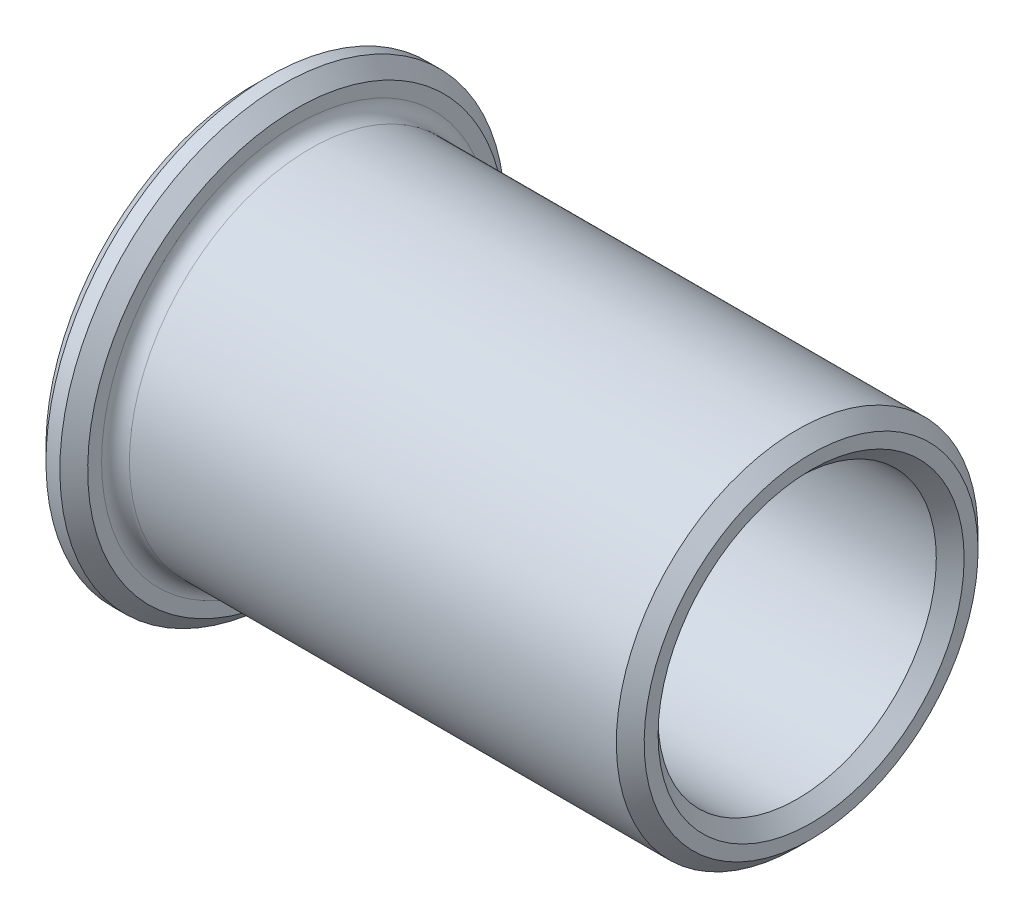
ISO-10303-21;
HEADER;
FILE_DESCRIPTION(('STEP AP214'),'2;1');
FILE_NAME('part.step','',(''),(''),'','','');
FILE_SCHEMA(('AUTOMOTIVE_DESIGN { 1 0 10303 214 1 1 1 1 }'));
ENDSEC;
DATA;
#1=APPLICATION_CONTEXT('core data for automotive mechanical design processes');
#2=APPLICATION_PROTOCOL_DEFINITION('international standard','automotive_design',2000,#1);
#3=PRODUCT_CONTEXT('',#1,'mechanical');
#4=PRODUCT('Part','Part','',(#3));
#5=PRODUCT_RELATED_PRODUCT_CATEGORY('part','',(#4));
#6=PRODUCT_DEFINITION_FORMATION('','',#4);
#7=PRODUCT_DEFINITION_CONTEXT('part definition',#1,'design');
#8=PRODUCT_DEFINITION('design','',#6,#7);
#9=PRODUCT_DEFINITION_SHAPE('','',#8);
#10=(LENGTH_UNIT() NAMED_UNIT(*) SI_UNIT(.MILLI.,.METRE.));
#11=(NAMED_UNIT(*) PLANE_ANGLE_UNIT() SI_UNIT($,.RADIAN.));
#12=(NAMED_UNIT(*) SI_UNIT($,.STERADIAN.) SOLID_ANGLE_UNIT());
#13=UNCERTAINTY_MEASURE_WITH_UNIT(LENGTH_MEASURE(1.E-05),#10,'distance_accuracy_value','');
#14=(GEOMETRIC_REPRESENTATION_CONTEXT(3) GLOBAL_UNCERTAINTY_ASSIGNED_CONTEXT((#13)) GLOBAL_UNIT_ASSIGNED_CONTEXT((#10,
#11,#12)) REPRESENTATION_CONTEXT('',''));
#15=CARTESIAN_POINT('',(0.,0.,0.));
#16=DIRECTION('',(0.,0.,1.));
#17=DIRECTION('',(1.,0.,0.));
#18=AXIS2_PLACEMENT_3D('',#15,#16,#17);
#19=CARTESIAN_POINT('',(-1.5,-6.5,0.));
#20=DIRECTION('',(-1.,0.,0.));
#21=DIRECTION('',(0.,-1.,0.));
#22=AXIS2_PLACEMENT_3D('',#19,#20,#21);
#23=PLANE('',#22);
#24=CARTESIAN_POINT('',(-1.5,0.,0.));
#25=DIRECTION('',(1.,0.,0.));
#26=DIRECTION('',(0.,-1.,0.));
#27=AXIS2_PLACEMENT_3D('',#24,#25,#26);
#28=CIRCLE('',#27,5.50000000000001);
#29=CARTESIAN_POINT('',(-1.5,-5.50000000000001,0.));
#30=VERTEX_POINT('',#29);
#31=EDGE_CURVE('E8',#30,#30,#28,.T.);
#32=ORIENTED_EDGE('',*,*,#31,.T.);
#33=EDGE_LOOP('',(#32));
#34=FACE_BOUND('',#33,.T.);
#35=CARTESIAN_POINT('',(-1.5,0.,0.));
#36=DIRECTION('',(1.,0.,0.));
#37=DIRECTION('',(0.,-1.,0.));
#38=AXIS2_PLACEMENT_3D('',#35,#36,#37);
#39=CIRCLE('',#38,7.5);
#40=CARTESIAN_POINT('',(-1.5,-7.5,0.));
#41=VERTEX_POINT('',#40);
#42=EDGE_CURVE('E56',#41,#41,#39,.T.);
#43=ORIENTED_EDGE('',*,*,#42,.F.);
#44=EDGE_LOOP('',(#43));
#45=FACE_BOUND('',#44,.T.);
#46=ADVANCED_FACE('F13',(#34,#45),#23,.T.);
#47=CARTESIAN_POINT('',(18.5,-5.75,0.));
#48=DIRECTION('',(1.,0.,0.));
#49=DIRECTION('',(0.,1.,0.));
#50=AXIS2_PLACEMENT_3D('',#47,#48,#49);
#51=PLANE('',#50);
#52=CARTESIAN_POINT('',(18.5,0.,0.));
#53=DIRECTION('',(1.,0.,0.));
#54=DIRECTION('',(0.,-1.,0.));
#55=AXIS2_PLACEMENT_3D('',#52,#53,#54);
#56=CIRCLE('',#55,5.5);
#57=CARTESIAN_POINT('',(18.5,-5.5,0.));
#58=VERTEX_POINT('',#57);
#59=EDGE_CURVE('E41',#58,#58,#56,.T.);
#60=ORIENTED_EDGE('',*,*,#59,.F.);
#61=EDGE_LOOP('',(#60));
#62=FACE_BOUND('',#61,.T.);
#63=CARTESIAN_POINT('',(18.5,0.,0.));
#64=DIRECTION('',(1.,0.,0.));
#65=DIRECTION('',(0.,-1.,0.));
#66=AXIS2_PLACEMENT_3D('',#63,#64,#65);
#67=CIRCLE('',#66,6.);
#68=CARTESIAN_POINT('',(18.5,-6.,0.));
#69=VERTEX_POINT('',#68);
#70=EDGE_CURVE('E22',#69,#69,#67,.T.);
#71=ORIENTED_EDGE('',*,*,#70,.T.);
#72=EDGE_LOOP('',(#71));
#73=FACE_BOUND('',#72,.T.);
#74=ADVANCED_FACE('F102',(#62,#73),#51,.T.);
#75=CARTESIAN_POINT('',(0.,-7.25,0.));
#76=DIRECTION('',(1.,0.,0.));
#77=DIRECTION('',(0.,1.,0.));
#78=AXIS2_PLACEMENT_3D('',#75,#76,#77);
#79=PLANE('',#78);
#80=CARTESIAN_POINT('',(0.,0.,0.));
#81=DIRECTION('',(1.,0.,0.));
#82=DIRECTION('',(0.,-1.,0.));
#83=AXIS2_PLACEMENT_3D('',#80,#81,#82);
#84=CIRCLE('',#83,7.);
#85=CARTESIAN_POINT('',(0.,-7.,0.));
#86=VERTEX_POINT('',#85);
#87=EDGE_CURVE('E46',#86,#86,#84,.T.);
#88=ORIENTED_EDGE('',*,*,#87,.F.);
#89=EDGE_LOOP('',(#88));
#90=FACE_BOUND('',#89,.T.);
#91=CARTESIAN_POINT('',(0.,0.,0.));
#92=DIRECTION('',(1.,0.,0.));
#93=DIRECTION('',(0.,-1.,0.));
#94=AXIS2_PLACEMENT_3D('',#91,#92,#93);
#95=CIRCLE('',#94,7.5);
#96=CARTESIAN_POINT('',(0.,-7.5,0.));
#97=VERTEX_POINT('',#96);
#98=EDGE_CURVE('E31',#97,#97,#95,.T.);
#99=ORIENTED_EDGE('',*,*,#98,.T.);
#100=EDGE_LOOP('',(#99));
#101=FACE_BOUND('',#100,.T.);
#102=ADVANCED_FACE('F107',(#90,#101),#79,.T.);
#103=CARTESIAN_POINT('',(-0.75,0.,0.));
#104=DIRECTION('',(1.,0.,0.));
#105=DIRECTION('',(0.,1.,0.));
#106=AXIS2_PLACEMENT_3D('',#103,#104,#105);
#107=CYLINDRICAL_SURFACE('',#106,8.);
#108=CARTESIAN_POINT('',(-0.5,0.,0.));
#109=DIRECTION('',(1.,0.,0.));
#110=DIRECTION('',(0.,-1.,0.));
#111=AXIS2_PLACEMENT_3D('',#108,#109,#110);
#112=CIRCLE('',#111,8.);
#113=CARTESIAN_POINT('',(-0.500000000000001,-8.,0.));
#114=VERTEX_POINT('',#113);
#115=EDGE_CURVE('E51',#114,#114,#112,.T.);
#116=ORIENTED_EDGE('',*,*,#115,.F.);
#117=EDGE_LOOP('',(#116));
#118=FACE_BOUND('',#117,.T.);
#119=CARTESIAN_POINT('',(-1.,0.,0.));
#120=DIRECTION('',(1.,0.,0.));
#121=DIRECTION('',(0.,-1.,0.));
#122=AXIS2_PLACEMENT_3D('',#119,#120,#121);
#123=CIRCLE('',#122,8.);
#124=CARTESIAN_POINT('',(-1.,-8.,0.));
#125=VERTEX_POINT('',#124);
#126=EDGE_CURVE('E42',#125,#125,#123,.T.);
#127=ORIENTED_EDGE('',*,*,#126,.T.);
#128=EDGE_LOOP('',(#127));
#129=FACE_BOUND('',#128,.T.);
#130=ADVANCED_FACE('F70',(#118,#129),#107,.T.);
#131=DIRECTION('',(0.707106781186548,0.707106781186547,0.));
#132=VECTOR('',#131,1.);
#133=CARTESIAN_POINT('',(-0.250000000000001,-7.75,0.));
#134=LINE('',#133,#132);
#135=CARTESIAN_POINT('',(7.50000000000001,0.,0.));
#136=DIRECTION('',(-1.,0.,0.));
#137=AXIS1_PLACEMENT('',#135,#136);
#138=SURFACE_OF_REVOLUTION('',#134,#137);
#139=ORIENTED_EDGE('',*,*,#98,.F.);
#140=EDGE_LOOP('',(#139));
#141=FACE_BOUND('',#140,.T.);
#142=ORIENTED_EDGE('',*,*,#115,.T.);
#143=EDGE_LOOP('',(#142));
#144=FACE_BOUND('',#143,.T.);
#145=ADVANCED_FACE('F65',(#141,#144),#138,.F.);
#146=CARTESIAN_POINT('',(0.5,0.,0.));
#147=DIRECTION('',(1.,0.,0.));
#148=DIRECTION('',(0.,0.,-1.));
#149=AXIS2_PLACEMENT_3D('',#146,#147,#148);
#150=TOROIDAL_SURFACE('',#149,7.,0.5);
#151=ORIENTED_EDGE('',*,*,#87,.T.);
#152=EDGE_LOOP('',(#151));
#153=FACE_BOUND('',#152,.T.);
#154=CARTESIAN_POINT('',(0.5,0.,0.));
#155=DIRECTION('',(1.,0.,0.));
#156=DIRECTION('',(0.,-1.,0.));
#157=AXIS2_PLACEMENT_3D('',#154,#155,#156);
#158=CIRCLE('',#157,6.5);
#159=CARTESIAN_POINT('',(0.499999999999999,-6.5,0.));
#160=VERTEX_POINT('',#159);
#161=EDGE_CURVE('E47',#160,#160,#158,.T.);
#162=ORIENTED_EDGE('',*,*,#161,.F.);
#163=EDGE_LOOP('',(#162));
#164=FACE_BOUND('',#163,.T.);
#165=ADVANCED_FACE('F69',(#153,#164),#150,.F.);
#166=CARTESIAN_POINT('',(9.25,0.,0.));
#167=DIRECTION('',(1.,0.,0.));
#168=DIRECTION('',(0.,1.,0.));
#169=AXIS2_PLACEMENT_3D('',#166,#167,#168);
#170=CYLINDRICAL_SURFACE('',#169,6.5);
#171=CARTESIAN_POINT('',(18.,0.,0.));
#172=DIRECTION('',(1.,0.,0.));
#173=DIRECTION('',(0.,-1.,0.));
#174=AXIS2_PLACEMENT_3D('',#171,#172,#173);
#175=CIRCLE('',#174,6.5);
#176=CARTESIAN_POINT('',(18.,-6.5,0.));
#177=VERTEX_POINT('',#176);
#178=EDGE_CURVE('E50',#177,#177,#175,.T.);
#179=ORIENTED_EDGE('',*,*,#178,.F.);
#180=EDGE_LOOP('',(#179));
#181=FACE_BOUND('',#180,.T.);
#182=ORIENTED_EDGE('',*,*,#161,.T.);
#183=EDGE_LOOP('',(#182));
#184=FACE_BOUND('',#183,.T.);
#185=ADVANCED_FACE('F75',(#181,#184),#170,.T.);
#186=DIRECTION('',(0.707106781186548,0.707106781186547,0.));
#187=VECTOR('',#186,1.);
#188=CARTESIAN_POINT('',(-498975.5,-499000.,-1.22215714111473E-10));
#189=LINE('',#188,#187);
#190=CARTESIAN_POINT('',(24.5,0.,0.));
#191=DIRECTION('',(-1.,0.,0.));
#192=AXIS1_PLACEMENT('',#190,#191);
#193=SURFACE_OF_REVOLUTION('',#189,#192);
#194=ORIENTED_EDGE('',*,*,#70,.F.);
#195=EDGE_LOOP('',(#194));
#196=FACE_BOUND('',#195,.T.);
#197=ORIENTED_EDGE('',*,*,#178,.T.);
#198=EDGE_LOOP('',(#197));
#199=FACE_BOUND('',#198,.T.);
#200=ADVANCED_FACE('F79',(#196,#199),#193,.F.);
#201=DIRECTION('',(0.707106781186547,-0.707106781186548,0.));
#202=VECTOR('',#201,1.);
#203=CARTESIAN_POINT('',(499000.,-498987.000000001,-1.22212530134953E-10));
#204=LINE('',#203,#202);
#205=CARTESIAN_POINT('',(13.,0.,0.));
#206=DIRECTION('',(1.,0.,0.));
#207=AXIS1_PLACEMENT('',#205,#206);
#208=SURFACE_OF_REVOLUTION('',#204,#207);
#209=ORIENTED_EDGE('',*,*,#59,.T.);
#210=EDGE_LOOP('',(#209));
#211=FACE_BOUND('',#210,.T.);
#212=CARTESIAN_POINT('',(18.,0.,0.));
#213=DIRECTION('',(1.,0.,0.));
#214=DIRECTION('',(0.,-1.,0.));
#215=AXIS2_PLACEMENT_3D('',#212,#213,#214);
#216=CIRCLE('',#215,5.);
#217=CARTESIAN_POINT('',(18.,-5.,0.));
#218=VERTEX_POINT('',#217);
#219=EDGE_CURVE('E37',#218,#218,#216,.T.);
#220=ORIENTED_EDGE('',*,*,#219,.F.);
#221=EDGE_LOOP('',(#220));
#222=FACE_BOUND('',#221,.T.);
#223=ADVANCED_FACE('F83',(#211,#222),#208,.F.);
#224=CARTESIAN_POINT('',(8.5,0.,0.));
#225=DIRECTION('',(1.,0.,0.));
#226=DIRECTION('',(0.,1.,0.));
#227=AXIS2_PLACEMENT_3D('',#224,#225,#226);
#228=CYLINDRICAL_SURFACE('',#227,5.);
#229=CARTESIAN_POINT('',(-0.999999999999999,0.,0.));
#230=DIRECTION('',(1.,0.,0.));
#231=DIRECTION('',(0.,-1.,0.));
#232=AXIS2_PLACEMENT_3D('',#229,#230,#231);
#233=CIRCLE('',#232,5.00000000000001);
#234=CARTESIAN_POINT('',(-1.,-5.00000000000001,0.));
#235=VERTEX_POINT('',#234);
#236=EDGE_CURVE('E35',#235,#235,#233,.T.);
#237=ORIENTED_EDGE('',*,*,#236,.F.);
#238=EDGE_LOOP('',(#237));
#239=FACE_BOUND('',#238,.T.);
#240=ORIENTED_EDGE('',*,*,#219,.T.);
#241=EDGE_LOOP('',(#240));
#242=FACE_BOUND('',#241,.T.);
#243=ADVANCED_FACE('F15',(#239,#242),#228,.F.);
#244=DIRECTION('',(-0.707106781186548,-0.707106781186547,0.));
#245=VECTOR('',#244,1.);
#246=CARTESIAN_POINT('',(-498996.000000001,-499000.,-1.22215714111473E-10));
#247=LINE('',#246,#245);
#248=CARTESIAN_POINT('',(4.00000000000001,0.,0.));
#249=DIRECTION('',(-1.,0.,0.));
#250=AXIS1_PLACEMENT('',#248,#249);
#251=SURFACE_OF_REVOLUTION('',#247,#250);
#252=ORIENTED_EDGE('',*,*,#31,.F.);
#253=EDGE_LOOP('',(#252));
#254=FACE_BOUND('',#253,.T.);
#255=ORIENTED_EDGE('',*,*,#236,.T.);
#256=EDGE_LOOP('',(#255));
#257=FACE_BOUND('',#256,.T.);
#258=ADVANCED_FACE('F90',(#254,#257),#251,.F.);
#259=DIRECTION('',(-0.707106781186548,0.707106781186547,0.));
#260=VECTOR('',#259,1.);
#261=CARTESIAN_POINT('',(-1.25,-7.75,0.));
#262=LINE('',#261,#260);
#263=CARTESIAN_POINT('',(-9.00000000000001,0.,0.));
#264=DIRECTION('',(1.,0.,0.));
#265=AXIS1_PLACEMENT('',#263,#264);
#266=SURFACE_OF_REVOLUTION('',#262,#265);
#267=ORIENTED_EDGE('',*,*,#42,.T.);
#268=EDGE_LOOP('',(#267));
#269=FACE_BOUND('',#268,.T.);
#270=ORIENTED_EDGE('',*,*,#126,.F.);
#271=EDGE_LOOP('',(#270));
#272=FACE_BOUND('',#271,.T.);
#273=ADVANCED_FACE('F92',(#269,#272),#266,.F.);
#274=CLOSED_SHELL('',(#46,#74,#102,#130,#145,#165,#185,#200,#223,#243,#258,#273));
#275=MANIFOLD_SOLID_BREP('B1',#274);
#276=ADVANCED_BREP_SHAPE_REPRESENTATION('',(#18,#275),#14);
#277=SHAPE_DEFINITION_REPRESENTATION(#9,#276);
ENDSEC;
END-ISO-10303-21;
